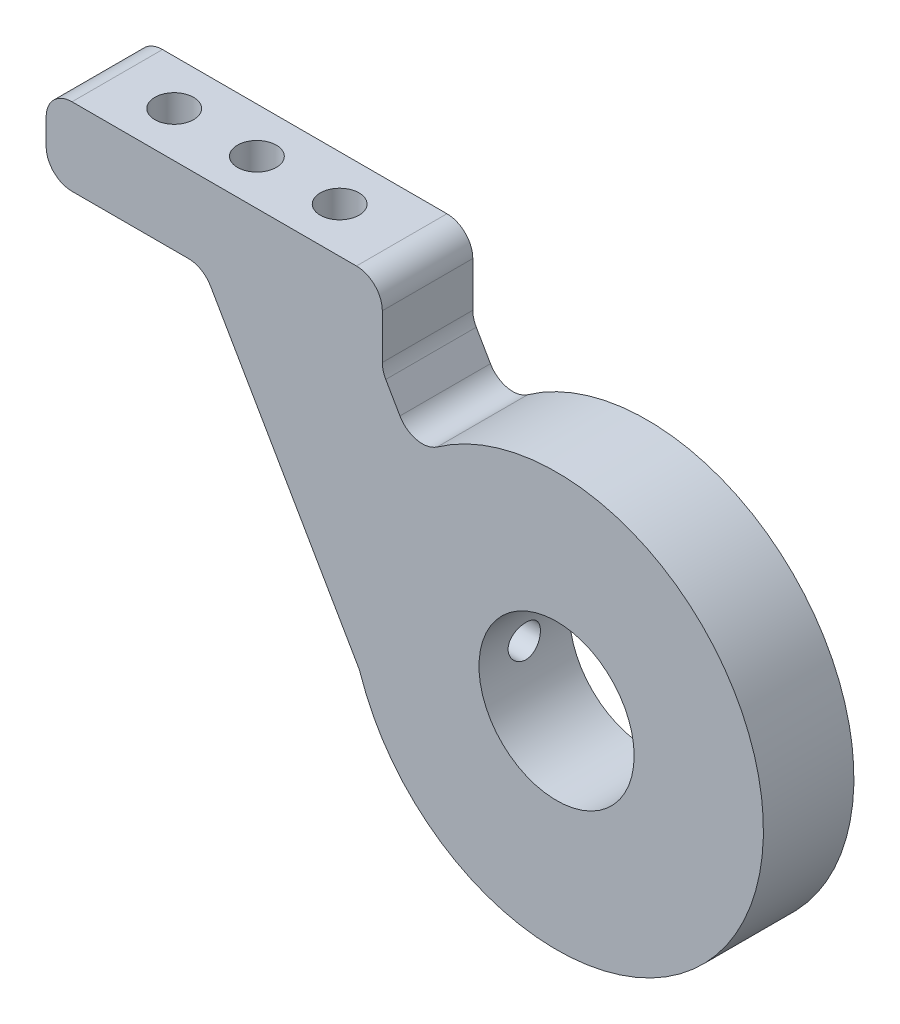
ISO-10303-21;
HEADER;
FILE_DESCRIPTION(('STEP AP214'),'2;1');
FILE_NAME('part.step','',(''),(''),'','','');
FILE_SCHEMA(('AUTOMOTIVE_DESIGN { 1 0 10303 214 1 1 1 1 }'));
ENDSEC;
DATA;
#1=APPLICATION_CONTEXT('core data for automotive mechanical design processes');
#2=APPLICATION_PROTOCOL_DEFINITION('international standard','automotive_design',2000,#1);
#3=PRODUCT_CONTEXT('',#1,'mechanical');
#4=PRODUCT('Part','Part','',(#3));
#5=PRODUCT_RELATED_PRODUCT_CATEGORY('part','',(#4));
#6=PRODUCT_DEFINITION_FORMATION('','',#4);
#7=PRODUCT_DEFINITION_CONTEXT('part definition',#1,'design');
#8=PRODUCT_DEFINITION('design','',#6,#7);
#9=PRODUCT_DEFINITION_SHAPE('','',#8);
#10=(LENGTH_UNIT() NAMED_UNIT(*) SI_UNIT(.MILLI.,.METRE.));
#11=(NAMED_UNIT(*) PLANE_ANGLE_UNIT() SI_UNIT($,.RADIAN.));
#12=(NAMED_UNIT(*) SI_UNIT($,.STERADIAN.) SOLID_ANGLE_UNIT());
#13=UNCERTAINTY_MEASURE_WITH_UNIT(LENGTH_MEASURE(1.E-05),#10,'distance_accuracy_value','');
#14=(GEOMETRIC_REPRESENTATION_CONTEXT(3) GLOBAL_UNCERTAINTY_ASSIGNED_CONTEXT((#13)) GLOBAL_UNIT_ASSIGNED_CONTEXT((#10,
#11,#12)) REPRESENTATION_CONTEXT('',''));
#15=CARTESIAN_POINT('',(0.,0.,0.));
#16=DIRECTION('',(0.,0.,1.));
#17=DIRECTION('',(1.,0.,0.));
#18=AXIS2_PLACEMENT_3D('',#15,#16,#17);
#19=CARTESIAN_POINT('',(-171.704,0.,11.1125));
#20=DIRECTION('',(1.,0.,0.));
#21=DIRECTION('',(0.,0.,-1.));
#22=AXIS2_PLACEMENT_3D('',#19,#20,#21);
#23=CYLINDRICAL_SURFACE('',#22,3.96875);
#24=CARTESIAN_POINT('',(-19.05,0.,7.14375));
#25=CARTESIAN_POINT('',(-19.0499959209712,-0.220373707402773,7.14375786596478));
#26=CARTESIAN_POINT('',(-19.0461369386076,-0.44084490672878,7.16216711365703));
#27=CARTESIAN_POINT('',(-19.0311151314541,-0.875542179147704,7.2352514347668));
#28=CARTESIAN_POINT('',(-19.0199467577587,-1.08976337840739,7.28995406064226));
#29=CARTESIAN_POINT('',(-18.9915517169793,-1.50561399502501,7.43385119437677));
#30=CARTESIAN_POINT('',(-18.974331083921,-1.70725571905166,7.52301135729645));
#31=CARTESIAN_POINT('',(-18.9356977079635,-2.09270704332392,7.73318750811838));
#32=CARTESIAN_POINT('',(-18.9142851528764,-2.27651744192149,7.8542020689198));
#33=CARTESIAN_POINT('',(-18.8692694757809,-2.62378927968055,8.12652788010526));
#34=CARTESIAN_POINT('',(-18.8456413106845,-2.78695227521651,8.27821560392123));
#35=CARTESIAN_POINT('',(-18.7990371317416,-3.08571194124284,8.60677304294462));
#36=CARTESIAN_POINT('',(-18.7760611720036,-3.22130633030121,8.78364484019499));
#37=CARTESIAN_POINT('',(-18.7331173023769,-3.46237025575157,9.15972250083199));
#38=CARTESIAN_POINT('',(-18.7131815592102,-3.56752698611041,9.35913287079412));
#39=CARTESIAN_POINT('',(-18.6789326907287,-3.74272553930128,9.77327690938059));
#40=CARTESIAN_POINT('',(-18.6646189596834,-3.81277114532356,9.98800892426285));
#41=CARTESIAN_POINT('',(-18.6434889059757,-3.91478262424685,10.4234781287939));
#42=CARTESIAN_POINT('',(-18.6365691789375,-3.94727422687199,10.6440870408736));
#43=CARTESIAN_POINT('',(-18.6306996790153,-3.9748891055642,11.0877249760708));
#44=CARTESIAN_POINT('',(-18.6317490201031,-3.97001653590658,11.3107537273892));
#45=CARTESIAN_POINT('',(-18.6416052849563,-3.9234655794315,11.7490272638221));
#46=CARTESIAN_POINT('',(-18.6502844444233,-3.882393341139,11.9643397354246));
#47=CARTESIAN_POINT('',(-18.6742208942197,-3.76556725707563,12.3849495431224));
#48=CARTESIAN_POINT('',(-18.6894785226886,-3.68981162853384,12.5902463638));
#49=CARTESIAN_POINT('',(-18.7249813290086,-3.50520010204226,12.9867254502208));
#50=CARTESIAN_POINT('',(-18.7452620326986,-3.39610708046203,13.1777939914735));
#51=CARTESIAN_POINT('',(-18.7885035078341,-3.14808457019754,13.5391389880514));
#52=CARTESIAN_POINT('',(-18.8114646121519,-3.00915137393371,13.7094128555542));
#53=CARTESIAN_POINT('',(-18.8580309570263,-2.70216287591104,14.0278293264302));
#54=CARTESIAN_POINT('',(-18.8816400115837,-2.53359105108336,14.175473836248));
#55=CARTESIAN_POINT('',(-18.9264317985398,-2.17381864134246,14.440472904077));
#56=CARTESIAN_POINT('',(-18.9476144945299,-1.9826177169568,14.5578270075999));
#57=CARTESIAN_POINT('',(-18.9852259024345,-1.58243759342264,14.7590195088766));
#58=CARTESIAN_POINT('',(-19.0016460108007,-1.37342709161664,14.8427973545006));
#59=CARTESIAN_POINT('',(-19.0278174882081,-0.943878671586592,14.9739086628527));
#60=CARTESIAN_POINT('',(-19.0375697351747,-0.723342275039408,15.0212469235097));
#61=CARTESIAN_POINT('',(-19.0491832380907,-0.28127917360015,15.0774217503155));
#62=CARTESIAN_POINT('',(-19.0511840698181,-0.0598425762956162,15.0869394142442));
#63=CARTESIAN_POINT('',(-19.0474584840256,0.381456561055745,15.0690422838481));
#64=CARTESIAN_POINT('',(-19.041732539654,0.601319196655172,15.0416297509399));
#65=CARTESIAN_POINT('',(-19.023284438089,1.03100621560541,14.9512158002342));
#66=CARTESIAN_POINT('',(-19.010631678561,1.2409080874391,14.8885672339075));
#67=CARTESIAN_POINT('',(-18.9797444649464,1.64722634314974,14.729847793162));
#68=CARTESIAN_POINT('',(-18.9615095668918,1.84364165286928,14.6337742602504));
#69=CARTESIAN_POINT('',(-18.9211344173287,2.22025942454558,14.4094822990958));
#70=CARTESIAN_POINT('',(-18.8989460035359,2.40021497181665,14.2808581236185));
#71=CARTESIAN_POINT('',(-18.8532315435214,2.73623229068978,13.9956553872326));
#72=CARTESIAN_POINT('',(-18.8297053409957,2.89229126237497,13.8390735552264));
#73=CARTESIAN_POINT('',(-18.7834912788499,3.17874220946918,13.499288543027));
#74=CARTESIAN_POINT('',(-18.760823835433,3.30866478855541,13.3156863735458));
#75=CARTESIAN_POINT('',(-18.719342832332,3.53582983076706,12.9288657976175));
#76=CARTESIAN_POINT('',(-18.7005291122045,3.63307365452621,12.7256482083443));
#77=CARTESIAN_POINT('',(-18.6690539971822,3.79149757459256,12.3064232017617));
#78=CARTESIAN_POINT('',(-18.6563594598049,3.85287233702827,12.0904919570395));
#79=CARTESIAN_POINT('',(-18.6384941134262,3.93839822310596,11.6510862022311));
#80=CARTESIAN_POINT('',(-18.6333222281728,3.96255467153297,11.4276127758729));
#81=CARTESIAN_POINT('',(-18.6311510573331,3.97274816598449,10.9841874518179));
#82=CARTESIAN_POINT('',(-18.6339925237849,3.95952797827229,10.7642530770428));
#83=CARTESIAN_POINT('',(-18.6471702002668,3.89699199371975,10.3298180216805));
#84=CARTESIAN_POINT('',(-18.65750633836,3.84767654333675,10.1153172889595));
#85=CARTESIAN_POINT('',(-18.6844347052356,3.71469341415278,9.69836207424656));
#86=CARTESIAN_POINT('',(-18.7010089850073,3.63112423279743,9.49587494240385));
#87=CARTESIAN_POINT('',(-18.7385549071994,3.43209426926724,9.10768188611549));
#88=CARTESIAN_POINT('',(-18.7595269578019,3.31663052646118,8.92197752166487));
#89=CARTESIAN_POINT('',(-18.8039876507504,3.05458398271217,8.56893883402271));
#90=CARTESIAN_POINT('',(-18.8275154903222,2.90746780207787,8.40200527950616));
#91=CARTESIAN_POINT('',(-18.8741634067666,2.58738509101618,8.09494985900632));
#92=CARTESIAN_POINT('',(-18.8972833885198,2.41441261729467,7.95483417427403));
#93=CARTESIAN_POINT('',(-18.9408258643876,2.04512680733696,7.7038562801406));
#94=CARTESIAN_POINT('',(-18.9612141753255,1.84856730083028,7.59335006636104));
#95=CARTESIAN_POINT('',(-18.9966570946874,1.43929050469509,7.40711552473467));
#96=CARTESIAN_POINT('',(-19.0117163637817,1.2265875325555,7.33135679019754));
#97=CARTESIAN_POINT('',(-19.0319818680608,0.844598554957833,7.23093461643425));
#98=CARTESIAN_POINT('',(-19.0386981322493,0.677442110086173,7.19830042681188));
#99=CARTESIAN_POINT('',(-19.0477086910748,0.340209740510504,7.15470548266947));
#100=CARTESIAN_POINT('',(-19.0500031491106,0.170133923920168,7.14374392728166));
#101=CARTESIAN_POINT('',(-19.05,0.,7.14375));
#102=B_SPLINE_CURVE_WITH_KNOTS('',3,(#24,#25,#26,#27,#28,#29,#30,#31,#32,#33,#34,#35,#36,#37,
#38,#39,#40,#41,#42,#43,#44,#45,#46,#47,#48,#49,#50,#51,#52,#53,#54,#55,#56,#57,#58,#59,#60,#61,
#62,#63,#64,#65,#66,#67,#68,#69,#70,#71,#72,#73,#74,#75,#76,#77,#78,#79,#80,#81,#82,#83,#84,#85,
#86,#87,#88,#89,#90,#91,#92,#93,#94,#95,#96,#97,#98,#99,#100,#101),.UNSPECIFIED.,.T.,.F.,(4,2,2,
2,2,2,2,2,2,2,2,2,2,2,2,2,2,2,2,2,2,2,2,2,2,2,2,2,2,2,2,2,2,2,2,2,2,2,4),(0.,0.660498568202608,
1.32149913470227,1.98184255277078,2.64215639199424,3.31112896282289,3.9801568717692,
4.65583426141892,5.33143883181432,5.99746626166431,6.66341964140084,7.31842936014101,
7.97347275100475,8.63328830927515,9.29318589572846,9.96599246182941,10.6388091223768,
11.3128337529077,11.9867696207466,12.6485122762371,13.3102144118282,13.9654053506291,
14.6206484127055,15.284500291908,15.9484298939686,16.6233876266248,17.2983172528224,
17.9695490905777,18.6406848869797,19.2985778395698,19.9564644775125,20.6124724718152,
21.2685413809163,21.9366790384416,22.6049705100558,23.280968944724,23.9563746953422,
24.466314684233,24.9762358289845),.UNSPECIFIED.);
#103=CARTESIAN_POINT('',(-19.05,0.,7.14375));
#104=VERTEX_POINT('',#103);
#105=EDGE_CURVE('E306',#104,#104,#102,.T.);
#106=ORIENTED_EDGE('',*,*,#105,.F.);
#107=EDGE_LOOP('',(#106));
#108=FACE_BOUND('',#107,.T.);
#109=CARTESIAN_POINT('',(-45.586351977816,0.,11.1125));
#110=DIRECTION('',(-1.,0.,0.));
#111=DIRECTION('',(0.,0.,1.));
#112=AXIS2_PLACEMENT_3D('',#109,#110,#111);
#113=CIRCLE('',#112,3.96875);
#114=CARTESIAN_POINT('',(-45.586351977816,0.,15.08125));
#115=VERTEX_POINT('',#114);
#116=EDGE_CURVE('E297',#115,#115,#113,.F.);
#117=ORIENTED_EDGE('',*,*,#116,.F.);
#118=EDGE_LOOP('',(#117));
#119=FACE_BOUND('',#118,.T.);
#120=ADVANCED_FACE('F46',(#108,#119),#23,.F.);
#121=CARTESIAN_POINT('',(0.,0.,22.225));
#122=DIRECTION('',(0.,0.,-1.));
#123=DIRECTION('',(-1.,0.,0.));
#124=AXIS2_PLACEMENT_3D('',#121,#122,#123);
#125=CYLINDRICAL_SURFACE('',#124,50.8);
#126=CARTESIAN_POINT('',(0.,0.,22.225));
#127=DIRECTION('',(0.,0.,1.));
#128=DIRECTION('',(1.,0.,0.));
#129=AXIS2_PLACEMENT_3D('',#126,#127,#128);
#130=CIRCLE('',#129,50.8);
#131=CARTESIAN_POINT('',(-48.1720455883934,-16.1274307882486,22.225));
#132=VERTEX_POINT('',#131);
#133=CARTESIAN_POINT('',(-29.3010075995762,41.4980837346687,22.225));
#134=VERTEX_POINT('',#133);
#135=EDGE_CURVE('E178',#132,#134,#130,.T.);
#136=ORIENTED_EDGE('',*,*,#135,.F.);
#137=DIRECTION('',(0.,0.,-1.));
#138=VECTOR('',#137,1.);
#139=CARTESIAN_POINT('',(-48.1720455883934,-16.1274307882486,22.225));
#140=LINE('',#139,#138);
#141=CARTESIAN_POINT('',(-48.1720455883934,-16.1274307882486,0.));
#142=VERTEX_POINT('',#141);
#143=EDGE_CURVE('E194',#132,#142,#140,.T.);
#144=ORIENTED_EDGE('',*,*,#143,.T.);
#145=CARTESIAN_POINT('',(0.,0.,0.));
#146=DIRECTION('',(0.,0.,1.));
#147=DIRECTION('',(1.,0.,0.));
#148=AXIS2_PLACEMENT_3D('',#145,#146,#147);
#149=CIRCLE('',#148,50.8);
#150=CARTESIAN_POINT('',(-29.3010075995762,41.4980837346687,0.));
#151=VERTEX_POINT('',#150);
#152=EDGE_CURVE('E185',#142,#151,#149,.T.);
#153=ORIENTED_EDGE('',*,*,#152,.T.);
#154=DIRECTION('',(0.,0.,-1.));
#155=VECTOR('',#154,1.);
#156=CARTESIAN_POINT('',(-29.3010075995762,41.4980837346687,22.225));
#157=LINE('',#156,#155);
#158=EDGE_CURVE('E182',#151,#134,#157,.F.);
#159=ORIENTED_EDGE('',*,*,#158,.T.);
#160=EDGE_LOOP('',(#136,#144,#153,#159));
#161=FACE_BOUND('',#160,.T.);
#162=ADVANCED_FACE('F271',(#161),#125,.T.);
#163=CARTESIAN_POINT('',(0.,0.,22.225));
#164=DIRECTION('',(0.,0.,1.));
#165=DIRECTION('',(1.,0.,0.));
#166=AXIS2_PLACEMENT_3D('',#163,#164,#165);
#167=PLANE('',#166);
#168=DIRECTION('',(1.,0.,0.));
#169=VECTOR('',#168,1.);
#170=CARTESIAN_POINT('',(-42.792351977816,70.0591838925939,22.225));
#171=LINE('',#170,#169);
#172=CARTESIAN_POINT('',(-118.992351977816,70.0591838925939,22.225));
#173=VERTEX_POINT('',#172);
#174=CARTESIAN_POINT('',(-49.142351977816,70.0591838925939,22.225));
#175=VERTEX_POINT('',#174);
#176=EDGE_CURVE('E595',#173,#175,#171,.T.);
#177=ORIENTED_EDGE('',*,*,#176,.F.);
#178=CARTESIAN_POINT('',(-118.992351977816,63.7091838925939,22.225));
#179=DIRECTION('',(0.,0.,1.));
#180=DIRECTION('',(1.,0.,0.));
#181=AXIS2_PLACEMENT_3D('',#178,#179,#180);
#182=CIRCLE('',#181,6.35);
#183=CARTESIAN_POINT('',(-125.342351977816,63.7091838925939,22.225));
#184=VERTEX_POINT('',#183);
#185=EDGE_CURVE('E211',#173,#184,#182,.T.);
#186=ORIENTED_EDGE('',*,*,#185,.T.);
#187=DIRECTION('',(0.,-1.,0.));
#188=VECTOR('',#187,1.);
#189=CARTESIAN_POINT('',(-125.342351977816,70.0591838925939,22.225));
#190=LINE('',#189,#188);
#191=CARTESIAN_POINT('',(-125.342351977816,57.359183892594,22.225));
#192=VERTEX_POINT('',#191);
#193=EDGE_CURVE('E594',#184,#192,#190,.T.);
#194=ORIENTED_EDGE('',*,*,#193,.T.);
#195=CARTESIAN_POINT('',(-118.992351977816,57.3591838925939,22.225));
#196=DIRECTION('',(0.,0.,1.));
#197=DIRECTION('',(1.,0.,0.));
#198=AXIS2_PLACEMENT_3D('',#195,#196,#197);
#199=CIRCLE('',#198,6.35);
#200=CARTESIAN_POINT('',(-118.992351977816,51.0091838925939,22.225));
#201=VERTEX_POINT('',#200);
#202=EDGE_CURVE('E208',#192,#201,#199,.T.);
#203=ORIENTED_EDGE('',*,*,#202,.T.);
#204=DIRECTION('',(1.,0.,0.));
#205=VECTOR('',#204,1.);
#206=CARTESIAN_POINT('',(-42.792351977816,51.0091838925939,22.225));
#207=LINE('',#206,#205);
#208=CARTESIAN_POINT('',(-90.4526166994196,51.0091838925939,22.225));
#209=VERTEX_POINT('',#208);
#210=EDGE_CURVE('E154',#201,#209,#207,.T.);
#211=ORIENTED_EDGE('',*,*,#210,.T.);
#212=CARTESIAN_POINT('',(-90.4526166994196,44.6591838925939,22.225));
#213=DIRECTION('',(0.,0.,1.));
#214=DIRECTION('',(1.,0.,0.));
#215=AXIS2_PLACEMENT_3D('',#212,#213,#214);
#216=CIRCLE('',#215,6.35);
#217=CARTESIAN_POINT('',(-84.9533553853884,47.8341838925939,22.225));
#218=VERTEX_POINT('',#217);
#219=EDGE_CURVE('E147',#209,#218,#216,.F.);
#220=ORIENTED_EDGE('',*,*,#219,.T.);
#221=DIRECTION('',(0.5,-0.866025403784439,0.));
#222=VECTOR('',#221,1.);
#223=CARTESIAN_POINT('',(-86.7864424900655,51.009183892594,22.225));
#224=LINE('',#223,#222);
#225=CARTESIAN_POINT('',(-48.6942899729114,-14.9683596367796,22.225));
#226=VERTEX_POINT('',#225);
#227=EDGE_CURVE('E152',#218,#226,#224,.T.);
#228=ORIENTED_EDGE('',*,*,#227,.T.);
#229=CARTESIAN_POINT('',(-54.1935512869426,-18.1433596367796,22.225));
#230=DIRECTION('',(0.,0.,1.));
#231=DIRECTION('',(1.,0.,0.));
#232=AXIS2_PLACEMENT_3D('',#229,#230,#231);
#233=CIRCLE('',#232,6.35);
#234=EDGE_CURVE('E248',#226,#132,#233,.F.);
#235=ORIENTED_EDGE('',*,*,#234,.T.);
#236=ORIENTED_EDGE('',*,*,#135,.T.);
#237=CARTESIAN_POINT('',(-32.9636335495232,46.6853442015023,22.225));
#238=DIRECTION('',(0.,0.,1.));
#239=DIRECTION('',(1.,0.,0.));
#240=AXIS2_PLACEMENT_3D('',#237,#238,#239);
#241=CIRCLE('',#240,6.35);
#242=CARTESIAN_POINT('',(-38.4628948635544,43.5103442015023,22.225));
#243=VERTEX_POINT('',#242);
#244=EDGE_CURVE('E255',#134,#243,#241,.F.);
#245=ORIENTED_EDGE('',*,*,#244,.T.);
#246=DIRECTION('',(-0.5,0.866025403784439,0.));
#247=VECTOR('',#246,1.);
#248=CARTESIAN_POINT('',(-34.7408746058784,37.0636160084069,22.225));
#249=LINE('',#248,#247);
#250=CARTESIAN_POINT('',(-41.9416132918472,49.5356612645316,22.225));
#251=VERTEX_POINT('',#250);
#252=EDGE_CURVE('E173',#243,#251,#249,.T.);
#253=ORIENTED_EDGE('',*,*,#252,.T.);
#254=CARTESIAN_POINT('',(-36.442351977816,52.7106612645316,22.225));
#255=DIRECTION('',(0.,0.,1.));
#256=DIRECTION('',(1.,0.,0.));
#257=AXIS2_PLACEMENT_3D('',#254,#255,#256);
#258=CIRCLE('',#257,6.35);
#259=CARTESIAN_POINT('',(-42.792351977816,52.7106612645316,22.225));
#260=VERTEX_POINT('',#259);
#261=EDGE_CURVE('E11',#251,#260,#258,.F.);
#262=ORIENTED_EDGE('',*,*,#261,.T.);
#263=DIRECTION('',(0.,-1.,0.));
#264=VECTOR('',#263,1.);
#265=CARTESIAN_POINT('',(-42.792351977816,70.0591838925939,22.225));
#266=LINE('',#265,#264);
#267=CARTESIAN_POINT('',(-42.792351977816,63.7091838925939,22.225));
#268=VERTEX_POINT('',#267);
#269=EDGE_CURVE('E589',#268,#260,#266,.T.);
#270=ORIENTED_EDGE('',*,*,#269,.F.);
#271=CARTESIAN_POINT('',(-49.142351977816,63.7091838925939,22.225));
#272=DIRECTION('',(0.,0.,1.));
#273=DIRECTION('',(1.,0.,0.));
#274=AXIS2_PLACEMENT_3D('',#271,#272,#273);
#275=CIRCLE('',#274,6.35);
#276=EDGE_CURVE('E205',#268,#175,#275,.T.);
#277=ORIENTED_EDGE('',*,*,#276,.T.);
#278=EDGE_LOOP('',(#177,#186,#194,#203,#211,#220,#228,#235,#236,#245,#253,#262,#270,#277));
#279=FACE_BOUND('',#278,.T.);
#280=CARTESIAN_POINT('',(0.,0.,22.225));
#281=DIRECTION('',(0.,0.,1.));
#282=DIRECTION('',(1.,0.,0.));
#283=AXIS2_PLACEMENT_3D('',#280,#281,#282);
#284=CIRCLE('',#283,19.05);
#285=CARTESIAN_POINT('',(19.05,0.,22.225));
#286=VERTEX_POINT('',#285);
#287=EDGE_CURVE('E294',#286,#286,#284,.T.);
#288=ORIENTED_EDGE('',*,*,#287,.F.);
#289=EDGE_LOOP('',(#288));
#290=FACE_BOUND('',#289,.T.);
#291=ADVANCED_FACE('F150',(#279,#290),#167,.T.);
#292=CARTESIAN_POINT('',(0.,0.,0.));
#293=DIRECTION('',(0.,0.,1.));
#294=DIRECTION('',(1.,0.,0.));
#295=AXIS2_PLACEMENT_3D('',#292,#293,#294);
#296=PLANE('',#295);
#297=CARTESIAN_POINT('',(0.,0.,0.));
#298=DIRECTION('',(0.,0.,1.));
#299=DIRECTION('',(1.,0.,0.));
#300=AXIS2_PLACEMENT_3D('',#297,#298,#299);
#301=CIRCLE('',#300,19.05);
#302=CARTESIAN_POINT('',(19.05,0.,0.));
#303=VERTEX_POINT('',#302);
#304=EDGE_CURVE('E274',#303,#303,#301,.T.);
#305=ORIENTED_EDGE('',*,*,#304,.T.);
#306=EDGE_LOOP('',(#305));
#307=FACE_BOUND('',#306,.T.);
#308=DIRECTION('',(0.,-1.,0.));
#309=VECTOR('',#308,1.);
#310=CARTESIAN_POINT('',(-125.342351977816,70.0591838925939,0.));
#311=LINE('',#310,#309);
#312=CARTESIAN_POINT('',(-125.342351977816,63.7091838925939,0.));
#313=VERTEX_POINT('',#312);
#314=CARTESIAN_POINT('',(-125.342351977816,57.359183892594,0.));
#315=VERTEX_POINT('',#314);
#316=EDGE_CURVE('E285',#313,#315,#311,.T.);
#317=ORIENTED_EDGE('',*,*,#316,.F.);
#318=CARTESIAN_POINT('',(-118.992351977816,63.7091838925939,0.));
#319=DIRECTION('',(0.,0.,1.));
#320=DIRECTION('',(1.,0.,0.));
#321=AXIS2_PLACEMENT_3D('',#318,#319,#320);
#322=CIRCLE('',#321,6.35);
#323=CARTESIAN_POINT('',(-118.992351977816,70.0591838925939,0.));
#324=VERTEX_POINT('',#323);
#325=EDGE_CURVE('E227',#313,#324,#322,.F.);
#326=ORIENTED_EDGE('',*,*,#325,.T.);
#327=DIRECTION('',(-1.,0.,0.));
#328=VECTOR('',#327,1.);
#329=CARTESIAN_POINT('',(-42.792351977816,70.0591838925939,0.));
#330=LINE('',#329,#328);
#331=CARTESIAN_POINT('',(-49.142351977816,70.0591838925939,0.));
#332=VERTEX_POINT('',#331);
#333=EDGE_CURVE('E602',#332,#324,#330,.T.);
#334=ORIENTED_EDGE('',*,*,#333,.F.);
#335=CARTESIAN_POINT('',(-49.142351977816,63.7091838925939,0.));
#336=DIRECTION('',(0.,0.,1.));
#337=DIRECTION('',(1.,0.,0.));
#338=AXIS2_PLACEMENT_3D('',#335,#336,#337);
#339=CIRCLE('',#338,6.35);
#340=CARTESIAN_POINT('',(-42.792351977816,63.7091838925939,0.));
#341=VERTEX_POINT('',#340);
#342=EDGE_CURVE('E221',#332,#341,#339,.F.);
#343=ORIENTED_EDGE('',*,*,#342,.T.);
#344=DIRECTION('',(0.,-1.,0.));
#345=VECTOR('',#344,1.);
#346=CARTESIAN_POINT('',(-42.792351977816,70.0591838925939,0.));
#347=LINE('',#346,#345);
#348=CARTESIAN_POINT('',(-42.792351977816,52.7106612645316,0.));
#349=VERTEX_POINT('',#348);
#350=EDGE_CURVE('E282',#341,#349,#347,.T.);
#351=ORIENTED_EDGE('',*,*,#350,.T.);
#352=CARTESIAN_POINT('',(-36.442351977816,52.7106612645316,0.));
#353=DIRECTION('',(0.,0.,1.));
#354=DIRECTION('',(1.,0.,0.));
#355=AXIS2_PLACEMENT_3D('',#352,#353,#354);
#356=CIRCLE('',#355,6.35);
#357=CARTESIAN_POINT('',(-41.9416132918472,49.5356612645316,0.));
#358=VERTEX_POINT('',#357);
#359=EDGE_CURVE('E55',#349,#358,#356,.T.);
#360=ORIENTED_EDGE('',*,*,#359,.T.);
#361=DIRECTION('',(-0.5,0.866025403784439,0.));
#362=VECTOR('',#361,1.);
#363=CARTESIAN_POINT('',(-34.7408746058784,37.0636160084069,0.));
#364=LINE('',#363,#362);
#365=CARTESIAN_POINT('',(-38.4628948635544,43.5103442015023,0.));
#366=VERTEX_POINT('',#365);
#367=EDGE_CURVE('E172',#366,#358,#364,.T.);
#368=ORIENTED_EDGE('',*,*,#367,.F.);
#369=CARTESIAN_POINT('',(-32.9636335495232,46.6853442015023,0.));
#370=DIRECTION('',(0.,0.,1.));
#371=DIRECTION('',(1.,0.,0.));
#372=AXIS2_PLACEMENT_3D('',#369,#370,#371);
#373=CIRCLE('',#372,6.35);
#374=EDGE_CURVE('E258',#366,#151,#373,.T.);
#375=ORIENTED_EDGE('',*,*,#374,.T.);
#376=ORIENTED_EDGE('',*,*,#152,.F.);
#377=CARTESIAN_POINT('',(-54.1935512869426,-18.1433596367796,0.));
#378=DIRECTION('',(0.,0.,1.));
#379=DIRECTION('',(1.,0.,0.));
#380=AXIS2_PLACEMENT_3D('',#377,#378,#379);
#381=CIRCLE('',#380,6.35);
#382=CARTESIAN_POINT('',(-48.6942899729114,-14.9683596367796,0.));
#383=VERTEX_POINT('',#382);
#384=EDGE_CURVE('E161',#142,#383,#381,.T.);
#385=ORIENTED_EDGE('',*,*,#384,.T.);
#386=DIRECTION('',(0.5,-0.866025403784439,0.));
#387=VECTOR('',#386,1.);
#388=CARTESIAN_POINT('',(-86.7864424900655,51.009183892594,0.));
#389=LINE('',#388,#387);
#390=CARTESIAN_POINT('',(-84.9533553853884,47.8341838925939,0.));
#391=VERTEX_POINT('',#390);
#392=EDGE_CURVE('E288',#391,#383,#389,.T.);
#393=ORIENTED_EDGE('',*,*,#392,.F.);
#394=CARTESIAN_POINT('',(-90.4526166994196,44.6591838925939,0.));
#395=DIRECTION('',(0.,0.,1.));
#396=DIRECTION('',(1.,0.,0.));
#397=AXIS2_PLACEMENT_3D('',#394,#395,#396);
#398=CIRCLE('',#397,6.35);
#399=CARTESIAN_POINT('',(-90.4526166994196,51.0091838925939,0.));
#400=VERTEX_POINT('',#399);
#401=EDGE_CURVE('E160',#391,#400,#398,.T.);
#402=ORIENTED_EDGE('',*,*,#401,.T.);
#403=DIRECTION('',(-1.,0.,0.));
#404=VECTOR('',#403,1.);
#405=CARTESIAN_POINT('',(-42.792351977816,51.0091838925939,0.));
#406=LINE('',#405,#404);
#407=CARTESIAN_POINT('',(-118.992351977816,51.0091838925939,0.));
#408=VERTEX_POINT('',#407);
#409=EDGE_CURVE('E613',#400,#408,#406,.T.);
#410=ORIENTED_EDGE('',*,*,#409,.T.);
#411=CARTESIAN_POINT('',(-118.992351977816,57.3591838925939,0.));
#412=DIRECTION('',(0.,0.,1.));
#413=DIRECTION('',(1.,0.,0.));
#414=AXIS2_PLACEMENT_3D('',#411,#412,#413);
#415=CIRCLE('',#414,6.35);
#416=EDGE_CURVE('E224',#408,#315,#415,.F.);
#417=ORIENTED_EDGE('',*,*,#416,.T.);
#418=EDGE_LOOP('',(#317,#326,#334,#343,#351,#360,#368,#375,#376,#385,#393,#402,#410,#417));
#419=FACE_BOUND('',#418,.T.);
#420=ADVANCED_FACE('F265',(#307,#419),#296,.F.);
#421=CARTESIAN_POINT('',(0.,0.,0.));
#422=DIRECTION('',(0.,0.,1.));
#423=DIRECTION('',(1.,0.,0.));
#424=AXIS2_PLACEMENT_3D('',#421,#422,#423);
#425=CYLINDRICAL_SURFACE('',#424,19.05);
#426=ORIENTED_EDGE('',*,*,#105,.T.);
#427=EDGE_LOOP('',(#426));
#428=FACE_BOUND('',#427,.T.);
#429=ORIENTED_EDGE('',*,*,#304,.F.);
#430=EDGE_LOOP('',(#429));
#431=FACE_BOUND('',#430,.T.);
#432=ORIENTED_EDGE('',*,*,#287,.T.);
#433=EDGE_LOOP('',(#432));
#434=FACE_BOUND('',#433,.T.);
#435=ADVANCED_FACE('F323',(#428,#431,#434),#425,.F.);
#436=CARTESIAN_POINT('',(-86.7864424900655,51.009183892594,0.));
#437=DIRECTION('',(-0.866025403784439,-0.5,0.));
#438=DIRECTION('',(0.5,-0.866025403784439,0.));
#439=AXIS2_PLACEMENT_3D('',#436,#437,#438);
#440=PLANE('',#439);
#441=CARTESIAN_POINT('',(-57.3362764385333,0.,11.1125));
#442=DIRECTION('',(-0.866025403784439,-0.5,0.));
#443=DIRECTION('',(-0.5,0.866025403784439,0.));
#444=AXIS2_PLACEMENT_3D('',#441,#442,#443);
#445=ELLIPSE('',#444,9.16543552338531,7.9375);
#446=CARTESIAN_POINT('',(-61.9189942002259,7.9375,11.1125));
#447=VERTEX_POINT('',#446);
#448=EDGE_CURVE('E188',#447,#447,#445,.T.);
#449=ORIENTED_EDGE('',*,*,#448,.F.);
#450=EDGE_LOOP('',(#449));
#451=FACE_BOUND('',#450,.T.);
#452=ORIENTED_EDGE('',*,*,#392,.T.);
#453=DIRECTION('',(0.,0.,-1.));
#454=VECTOR('',#453,1.);
#455=CARTESIAN_POINT('',(-48.6942899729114,-14.9683596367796,0.));
#456=LINE('',#455,#454);
#457=EDGE_CURVE('E170',#383,#226,#456,.F.);
#458=ORIENTED_EDGE('',*,*,#457,.T.);
#459=ORIENTED_EDGE('',*,*,#227,.F.);
#460=DIRECTION('',(0.,0.,1.));
#461=VECTOR('',#460,1.);
#462=CARTESIAN_POINT('',(-84.9533553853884,47.8341838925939,0.));
#463=LINE('',#462,#461);
#464=EDGE_CURVE('E167',#218,#391,#463,.F.);
#465=ORIENTED_EDGE('',*,*,#464,.T.);
#466=EDGE_LOOP('',(#452,#458,#459,#465));
#467=FACE_BOUND('',#466,.T.);
#468=ADVANCED_FACE('F166',(#451,#467),#440,.T.);
#469=CARTESIAN_POINT('',(-34.7408746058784,37.0636160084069,0.));
#470=DIRECTION('',(0.866025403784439,0.5,0.));
#471=DIRECTION('',(-0.5,0.866025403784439,0.));
#472=AXIS2_PLACEMENT_3D('',#469,#470,#471);
#473=PLANE('',#472);
#474=ORIENTED_EDGE('',*,*,#252,.F.);
#475=DIRECTION('',(0.,0.,-1.));
#476=VECTOR('',#475,1.);
#477=CARTESIAN_POINT('',(-38.4628948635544,43.5103442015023,0.));
#478=LINE('',#477,#476);
#479=EDGE_CURVE('E68',#243,#366,#478,.T.);
#480=ORIENTED_EDGE('',*,*,#479,.T.);
#481=ORIENTED_EDGE('',*,*,#367,.T.);
#482=DIRECTION('',(0.,0.,-1.));
#483=VECTOR('',#482,1.);
#484=CARTESIAN_POINT('',(-41.9416132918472,49.5356612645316,0.));
#485=LINE('',#484,#483);
#486=EDGE_CURVE('E236',#358,#251,#485,.F.);
#487=ORIENTED_EDGE('',*,*,#486,.T.);
#488=EDGE_LOOP('',(#474,#480,#481,#487));
#489=FACE_BOUND('',#488,.T.);
#490=ADVANCED_FACE('F279',(#489),#473,.T.);
#491=CARTESIAN_POINT('',(0.,51.0091838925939,0.));
#492=DIRECTION('',(0.,1.,0.));
#493=DIRECTION('',(0.,0.,1.));
#494=AXIS2_PLACEMENT_3D('',#491,#492,#493);
#495=PLANE('',#494);
#496=ORIENTED_EDGE('',*,*,#210,.F.);
#497=DIRECTION('',(0.,0.,1.));
#498=VECTOR('',#497,1.);
#499=CARTESIAN_POINT('',(-118.992351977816,51.0091838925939,0.));
#500=LINE('',#499,#498);
#501=EDGE_CURVE('E233',#201,#408,#500,.F.);
#502=ORIENTED_EDGE('',*,*,#501,.T.);
#503=ORIENTED_EDGE('',*,*,#409,.F.);
#504=DIRECTION('',(0.,0.,1.));
#505=VECTOR('',#504,1.);
#506=CARTESIAN_POINT('',(-90.4526166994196,51.0091838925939,0.));
#507=LINE('',#506,#505);
#508=EDGE_CURVE('E230',#400,#209,#507,.T.);
#509=ORIENTED_EDGE('',*,*,#508,.T.);
#510=EDGE_LOOP('',(#496,#502,#503,#509));
#511=FACE_BOUND('',#510,.T.);
#512=ADVANCED_FACE('F364',(#511),#495,.F.);
#513=CARTESIAN_POINT('',(-42.792351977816,70.0591838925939,22.225));
#514=DIRECTION('',(-1.,0.,0.));
#515=DIRECTION('',(0.,0.,1.));
#516=AXIS2_PLACEMENT_3D('',#513,#514,#515);
#517=PLANE('',#516);
#518=ORIENTED_EDGE('',*,*,#350,.F.);
#519=DIRECTION('',(0.,0.,-1.));
#520=VECTOR('',#519,1.);
#521=CARTESIAN_POINT('',(-42.792351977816,63.7091838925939,22.225));
#522=LINE('',#521,#520);
#523=EDGE_CURVE('E245',#341,#268,#522,.F.);
#524=ORIENTED_EDGE('',*,*,#523,.T.);
#525=ORIENTED_EDGE('',*,*,#269,.T.);
#526=DIRECTION('',(0.,0.,-1.));
#527=VECTOR('',#526,1.);
#528=CARTESIAN_POINT('',(-42.792351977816,52.7106612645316,22.225));
#529=LINE('',#528,#527);
#530=EDGE_CURVE('E241',#260,#349,#529,.T.);
#531=ORIENTED_EDGE('',*,*,#530,.T.);
#532=EDGE_LOOP('',(#518,#524,#525,#531));
#533=FACE_BOUND('',#532,.T.);
#534=ADVANCED_FACE('F367',(#533),#517,.F.);
#535=CARTESIAN_POINT('',(-125.342351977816,70.0591838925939,22.225));
#536=DIRECTION('',(1.,0.,0.));
#537=DIRECTION('',(0.,0.,-1.));
#538=AXIS2_PLACEMENT_3D('',#535,#536,#537);
#539=PLANE('',#538);
#540=ORIENTED_EDGE('',*,*,#193,.F.);
#541=DIRECTION('',(0.,0.,1.));
#542=VECTOR('',#541,1.);
#543=CARTESIAN_POINT('',(-125.342351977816,63.7091838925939,0.));
#544=LINE('',#543,#542);
#545=EDGE_CURVE('E218',#184,#313,#544,.F.);
#546=ORIENTED_EDGE('',*,*,#545,.T.);
#547=ORIENTED_EDGE('',*,*,#316,.T.);
#548=DIRECTION('',(0.,0.,1.));
#549=VECTOR('',#548,1.);
#550=CARTESIAN_POINT('',(-125.342351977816,57.3591838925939,22.225));
#551=LINE('',#550,#549);
#552=EDGE_CURVE('E214',#315,#192,#551,.T.);
#553=ORIENTED_EDGE('',*,*,#552,.T.);
#554=EDGE_LOOP('',(#540,#546,#547,#553));
#555=FACE_BOUND('',#554,.T.);
#556=ADVANCED_FACE('F362',(#555),#539,.F.);
#557=CARTESIAN_POINT('',(0.,70.0591838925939,0.));
#558=DIRECTION('',(0.,1.,0.));
#559=DIRECTION('',(0.,0.,1.));
#560=AXIS2_PLACEMENT_3D('',#557,#558,#559);
#561=PLANE('',#560);
#562=CARTESIAN_POINT('',(-105.022351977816,70.0591838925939,11.1125));
#563=DIRECTION('',(0.,1.,0.));
#564=DIRECTION('',(0.,0.,1.));
#565=AXIS2_PLACEMENT_3D('',#562,#563,#564);
#566=CIRCLE('',#565,4.7625);
#567=CARTESIAN_POINT('',(-105.022351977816,70.0591838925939,15.875));
#568=VERTEX_POINT('',#567);
#569=EDGE_CURVE('E620',#568,#568,#566,.T.);
#570=ORIENTED_EDGE('',*,*,#569,.F.);
#571=EDGE_LOOP('',(#570));
#572=FACE_BOUND('',#571,.T.);
#573=CARTESIAN_POINT('',(-64.382351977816,70.0591838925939,11.1125));
#574=DIRECTION('',(0.,1.,0.));
#575=DIRECTION('',(0.,0.,1.));
#576=AXIS2_PLACEMENT_3D('',#573,#574,#575);
#577=CIRCLE('',#576,4.7625);
#578=CARTESIAN_POINT('',(-64.382351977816,70.0591838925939,15.875));
#579=VERTEX_POINT('',#578);
#580=EDGE_CURVE('E636',#579,#579,#577,.T.);
#581=ORIENTED_EDGE('',*,*,#580,.F.);
#582=EDGE_LOOP('',(#581));
#583=FACE_BOUND('',#582,.T.);
#584=CARTESIAN_POINT('',(-84.702351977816,70.0591838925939,11.1125));
#585=DIRECTION('',(0.,1.,0.));
#586=DIRECTION('',(0.,0.,1.));
#587=AXIS2_PLACEMENT_3D('',#584,#585,#586);
#588=CIRCLE('',#587,4.7625);
#589=CARTESIAN_POINT('',(-84.702351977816,70.0591838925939,15.875));
#590=VERTEX_POINT('',#589);
#591=EDGE_CURVE('E628',#590,#590,#588,.T.);
#592=ORIENTED_EDGE('',*,*,#591,.F.);
#593=EDGE_LOOP('',(#592));
#594=FACE_BOUND('',#593,.T.);
#595=ORIENTED_EDGE('',*,*,#333,.T.);
#596=DIRECTION('',(0.,0.,1.));
#597=VECTOR('',#596,1.);
#598=CARTESIAN_POINT('',(-118.992351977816,70.0591838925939,22.225));
#599=LINE('',#598,#597);
#600=EDGE_CURVE('E201',#324,#173,#599,.T.);
#601=ORIENTED_EDGE('',*,*,#600,.T.);
#602=ORIENTED_EDGE('',*,*,#176,.T.);
#603=DIRECTION('',(0.,0.,-1.));
#604=VECTOR('',#603,1.);
#605=CARTESIAN_POINT('',(-49.142351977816,70.0591838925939,0.));
#606=LINE('',#605,#604);
#607=EDGE_CURVE('E197',#175,#332,#606,.T.);
#608=ORIENTED_EDGE('',*,*,#607,.T.);
#609=EDGE_LOOP('',(#595,#601,#602,#608));
#610=FACE_BOUND('',#609,.T.);
#611=ADVANCED_FACE('F355',(#572,#583,#594,#610),#561,.T.);
#612=CARTESIAN_POINT('',(-84.702351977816,57.3591838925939,11.1125));
#613=DIRECTION('',(0.,1.,0.));
#614=DIRECTION('',(0.,0.,1.));
#615=AXIS2_PLACEMENT_3D('',#612,#613,#614);
#616=CYLINDRICAL_SURFACE('',#615,4.7625);
#617=CARTESIAN_POINT('',(-84.702351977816,57.3591838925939,11.1125));
#618=DIRECTION('',(0.,1.,0.));
#619=DIRECTION('',(0.,0.,1.));
#620=AXIS2_PLACEMENT_3D('',#617,#618,#619);
#621=CIRCLE('',#620,4.7625);
#622=CARTESIAN_POINT('',(-84.702351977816,57.3591838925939,15.875));
#623=VERTEX_POINT('',#622);
#624=EDGE_CURVE('E320',#623,#623,#621,.T.);
#625=ORIENTED_EDGE('',*,*,#624,.F.);
#626=EDGE_LOOP('',(#625));
#627=FACE_BOUND('',#626,.T.);
#628=ORIENTED_EDGE('',*,*,#591,.T.);
#629=EDGE_LOOP('',(#628));
#630=FACE_BOUND('',#629,.T.);
#631=ADVANCED_FACE('F352',(#627,#630),#616,.F.);
#632=CARTESIAN_POINT('',(-84.702351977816,57.3591838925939,11.1125));
#633=DIRECTION('',(0.,1.,0.));
#634=DIRECTION('',(0.,0.,1.));
#635=AXIS2_PLACEMENT_3D('',#632,#633,#634);
#636=PLANE('',#635);
#637=ORIENTED_EDGE('',*,*,#624,.T.);
#638=EDGE_LOOP('',(#637));
#639=FACE_BOUND('',#638,.T.);
#640=ADVANCED_FACE('F347',(#639),#636,.T.);
#641=CARTESIAN_POINT('',(-64.382351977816,57.3591838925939,11.1125));
#642=DIRECTION('',(0.,1.,0.));
#643=DIRECTION('',(0.,0.,1.));
#644=AXIS2_PLACEMENT_3D('',#641,#642,#643);
#645=CYLINDRICAL_SURFACE('',#644,4.7625);
#646=CARTESIAN_POINT('',(-64.382351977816,57.3591838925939,11.1125));
#647=DIRECTION('',(0.,1.,0.));
#648=DIRECTION('',(0.,0.,1.));
#649=AXIS2_PLACEMENT_3D('',#646,#647,#648);
#650=CIRCLE('',#649,4.7625);
#651=CARTESIAN_POINT('',(-64.382351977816,57.3591838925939,15.875));
#652=VERTEX_POINT('',#651);
#653=EDGE_CURVE('E632',#652,#652,#650,.T.);
#654=ORIENTED_EDGE('',*,*,#653,.F.);
#655=EDGE_LOOP('',(#654));
#656=FACE_BOUND('',#655,.T.);
#657=ORIENTED_EDGE('',*,*,#580,.T.);
#658=EDGE_LOOP('',(#657));
#659=FACE_BOUND('',#658,.T.);
#660=ADVANCED_FACE('F344',(#656,#659),#645,.F.);
#661=CARTESIAN_POINT('',(-64.382351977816,57.3591838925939,11.1125));
#662=DIRECTION('',(0.,1.,0.));
#663=DIRECTION('',(0.,0.,1.));
#664=AXIS2_PLACEMENT_3D('',#661,#662,#663);
#665=PLANE('',#664);
#666=ORIENTED_EDGE('',*,*,#653,.T.);
#667=EDGE_LOOP('',(#666));
#668=FACE_BOUND('',#667,.T.);
#669=ADVANCED_FACE('F342',(#668),#665,.T.);
#670=CARTESIAN_POINT('',(-105.022351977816,57.3591838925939,11.1125));
#671=DIRECTION('',(0.,1.,0.));
#672=DIRECTION('',(0.,0.,1.));
#673=AXIS2_PLACEMENT_3D('',#670,#671,#672);
#674=CYLINDRICAL_SURFACE('',#673,4.7625);
#675=CARTESIAN_POINT('',(-105.022351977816,57.3591838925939,11.1125));
#676=DIRECTION('',(0.,1.,0.));
#677=DIRECTION('',(0.,0.,1.));
#678=AXIS2_PLACEMENT_3D('',#675,#676,#677);
#679=CIRCLE('',#678,4.7625);
#680=CARTESIAN_POINT('',(-105.022351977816,57.3591838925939,15.875));
#681=VERTEX_POINT('',#680);
#682=EDGE_CURVE('E321',#681,#681,#679,.T.);
#683=ORIENTED_EDGE('',*,*,#682,.F.);
#684=EDGE_LOOP('',(#683));
#685=FACE_BOUND('',#684,.T.);
#686=ORIENTED_EDGE('',*,*,#569,.T.);
#687=EDGE_LOOP('',(#686));
#688=FACE_BOUND('',#687,.T.);
#689=ADVANCED_FACE('F338',(#685,#688),#674,.F.);
#690=CARTESIAN_POINT('',(-105.022351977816,57.3591838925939,11.1125));
#691=DIRECTION('',(0.,1.,0.));
#692=DIRECTION('',(0.,0.,1.));
#693=AXIS2_PLACEMENT_3D('',#690,#691,#692);
#694=PLANE('',#693);
#695=ORIENTED_EDGE('',*,*,#682,.T.);
#696=EDGE_LOOP('',(#695));
#697=FACE_BOUND('',#696,.T.);
#698=ADVANCED_FACE('F334',(#697),#694,.T.);
#699=CARTESIAN_POINT('',(-45.586351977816,0.,11.1125));
#700=DIRECTION('',(-1.,0.,0.));
#701=DIRECTION('',(0.,0.,1.));
#702=AXIS2_PLACEMENT_3D('',#699,#700,#701);
#703=PLANE('',#702);
#704=CARTESIAN_POINT('',(-45.586351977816,0.,11.1125));
#705=DIRECTION('',(-1.,0.,0.));
#706=DIRECTION('',(0.,0.,1.));
#707=AXIS2_PLACEMENT_3D('',#704,#705,#706);
#708=CIRCLE('',#707,7.9375);
#709=CARTESIAN_POINT('',(-45.586351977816,0.,19.05));
#710=VERTEX_POINT('',#709);
#711=EDGE_CURVE('E300',#710,#710,#708,.T.);
#712=ORIENTED_EDGE('',*,*,#711,.T.);
#713=EDGE_LOOP('',(#712));
#714=FACE_BOUND('',#713,.T.);
#715=ORIENTED_EDGE('',*,*,#116,.T.);
#716=EDGE_LOOP('',(#715));
#717=FACE_BOUND('',#716,.T.);
#718=ADVANCED_FACE('F337',(#714,#717),#703,.T.);
#719=CARTESIAN_POINT('',(-45.586351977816,0.,11.1125));
#720=DIRECTION('',(-1.,0.,0.));
#721=DIRECTION('',(0.,0.,1.));
#722=AXIS2_PLACEMENT_3D('',#719,#720,#721);
#723=CYLINDRICAL_SURFACE('',#722,7.9375);
#724=ORIENTED_EDGE('',*,*,#448,.T.);
#725=EDGE_LOOP('',(#724));
#726=FACE_BOUND('',#725,.T.);
#727=ORIENTED_EDGE('',*,*,#711,.F.);
#728=EDGE_LOOP('',(#727));
#729=FACE_BOUND('',#728,.T.);
#730=ADVANCED_FACE('F332',(#726,#729),#723,.F.);
#731=CARTESIAN_POINT('',(-54.1935512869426,-18.1433596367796,22.225));
#732=DIRECTION('',(0.,0.,-1.));
#733=DIRECTION('',(-1.,0.,0.));
#734=AXIS2_PLACEMENT_3D('',#731,#732,#733);
#735=CYLINDRICAL_SURFACE('',#734,6.35);
#736=ORIENTED_EDGE('',*,*,#384,.F.);
#737=ORIENTED_EDGE('',*,*,#143,.F.);
#738=ORIENTED_EDGE('',*,*,#234,.F.);
#739=ORIENTED_EDGE('',*,*,#457,.F.);
#740=EDGE_LOOP('',(#736,#737,#738,#739));
#741=FACE_BOUND('',#740,.T.);
#742=ADVANCED_FACE('F410',(#741),#735,.F.);
#743=CARTESIAN_POINT('',(-118.992351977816,63.7091838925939,0.));
#744=DIRECTION('',(0.,0.,-1.));
#745=DIRECTION('',(-1.,0.,0.));
#746=AXIS2_PLACEMENT_3D('',#743,#744,#745);
#747=CYLINDRICAL_SURFACE('',#746,6.35);
#748=ORIENTED_EDGE('',*,*,#325,.F.);
#749=ORIENTED_EDGE('',*,*,#545,.F.);
#750=ORIENTED_EDGE('',*,*,#185,.F.);
#751=ORIENTED_EDGE('',*,*,#600,.F.);
#752=EDGE_LOOP('',(#748,#749,#750,#751));
#753=FACE_BOUND('',#752,.T.);
#754=ADVANCED_FACE('F414',(#753),#747,.T.);
#755=CARTESIAN_POINT('',(-118.992351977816,57.3591838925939,22.225));
#756=DIRECTION('',(0.,0.,1.));
#757=DIRECTION('',(1.,0.,0.));
#758=AXIS2_PLACEMENT_3D('',#755,#756,#757);
#759=CYLINDRICAL_SURFACE('',#758,6.35);
#760=ORIENTED_EDGE('',*,*,#416,.F.);
#761=ORIENTED_EDGE('',*,*,#501,.F.);
#762=ORIENTED_EDGE('',*,*,#202,.F.);
#763=ORIENTED_EDGE('',*,*,#552,.F.);
#764=EDGE_LOOP('',(#760,#761,#762,#763));
#765=FACE_BOUND('',#764,.T.);
#766=ADVANCED_FACE('F424',(#765),#759,.T.);
#767=CARTESIAN_POINT('',(-90.4526166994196,44.6591838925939,0.));
#768=DIRECTION('',(0.,0.,1.));
#769=DIRECTION('',(1.,0.,0.));
#770=AXIS2_PLACEMENT_3D('',#767,#768,#769);
#771=CYLINDRICAL_SURFACE('',#770,6.35);
#772=ORIENTED_EDGE('',*,*,#401,.F.);
#773=ORIENTED_EDGE('',*,*,#464,.F.);
#774=ORIENTED_EDGE('',*,*,#219,.F.);
#775=ORIENTED_EDGE('',*,*,#508,.F.);
#776=EDGE_LOOP('',(#772,#773,#774,#775));
#777=FACE_BOUND('',#776,.T.);
#778=ADVANCED_FACE('F176',(#777),#771,.F.);
#779=CARTESIAN_POINT('',(-32.9636335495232,46.6853442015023,22.225));
#780=DIRECTION('',(0.,0.,-1.));
#781=DIRECTION('',(-1.,0.,0.));
#782=AXIS2_PLACEMENT_3D('',#779,#780,#781);
#783=CYLINDRICAL_SURFACE('',#782,6.35);
#784=ORIENTED_EDGE('',*,*,#374,.F.);
#785=ORIENTED_EDGE('',*,*,#479,.F.);
#786=ORIENTED_EDGE('',*,*,#244,.F.);
#787=ORIENTED_EDGE('',*,*,#158,.F.);
#788=EDGE_LOOP('',(#784,#785,#786,#787));
#789=FACE_BOUND('',#788,.T.);
#790=ADVANCED_FACE('F276',(#789),#783,.F.);
#791=CARTESIAN_POINT('',(-49.142351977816,63.7091838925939,0.));
#792=DIRECTION('',(0.,0.,1.));
#793=DIRECTION('',(1.,0.,0.));
#794=AXIS2_PLACEMENT_3D('',#791,#792,#793);
#795=CYLINDRICAL_SURFACE('',#794,6.35);
#796=ORIENTED_EDGE('',*,*,#276,.F.);
#797=ORIENTED_EDGE('',*,*,#523,.F.);
#798=ORIENTED_EDGE('',*,*,#342,.F.);
#799=ORIENTED_EDGE('',*,*,#607,.F.);
#800=EDGE_LOOP('',(#796,#797,#798,#799));
#801=FACE_BOUND('',#800,.T.);
#802=ADVANCED_FACE('F448',(#801),#795,.T.);
#803=CARTESIAN_POINT('',(-36.442351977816,52.7106612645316,22.225));
#804=DIRECTION('',(0.,0.,-1.));
#805=DIRECTION('',(-1.,0.,0.));
#806=AXIS2_PLACEMENT_3D('',#803,#804,#805);
#807=CYLINDRICAL_SURFACE('',#806,6.35);
#808=ORIENTED_EDGE('',*,*,#261,.F.);
#809=ORIENTED_EDGE('',*,*,#486,.F.);
#810=ORIENTED_EDGE('',*,*,#359,.F.);
#811=ORIENTED_EDGE('',*,*,#530,.F.);
#812=EDGE_LOOP('',(#808,#809,#810,#811));
#813=FACE_BOUND('',#812,.T.);
#814=ADVANCED_FACE('F48',(#813),#807,.F.);
#815=CLOSED_SHELL('',(#120,#162,#291,#420,#435,#468,#490,#512,#534,#556,#611,#631,#640,#660,
#669,#689,#698,#718,#730,#742,#754,#766,#778,#790,#802,#814));
#816=MANIFOLD_SOLID_BREP('B2',#815);
#817=ADVANCED_BREP_SHAPE_REPRESENTATION('',(#18,#816),#14);
#818=SHAPE_DEFINITION_REPRESENTATION(#9,#817);
ENDSEC;
END-ISO-10303-21;
